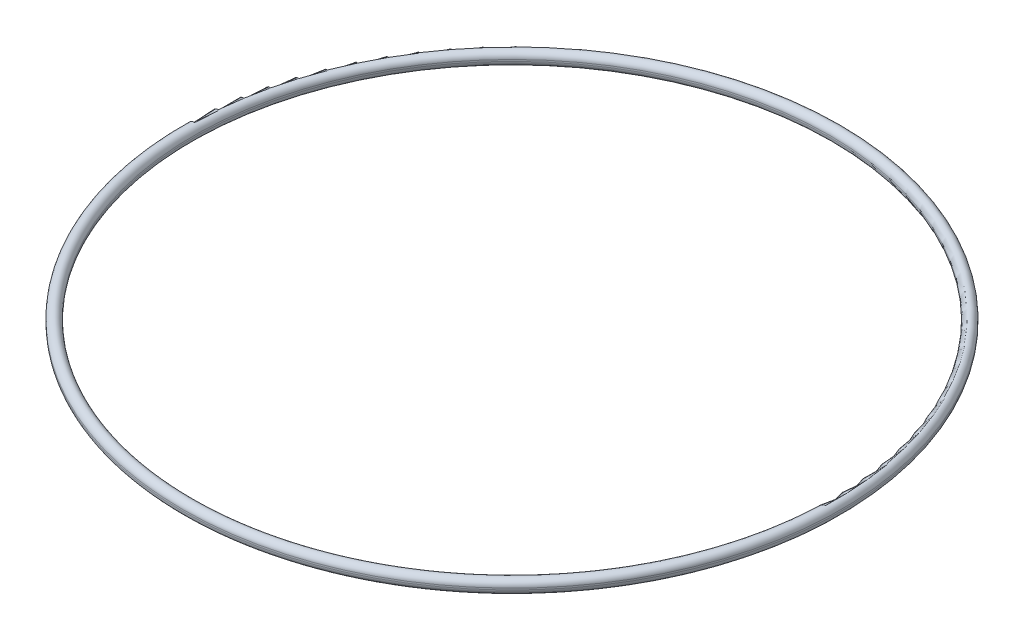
ISO-10303-21;
HEADER;
FILE_DESCRIPTION(('STEP AP214'),'2;1');
FILE_NAME('part.step','',(''),(''),'','','');
FILE_SCHEMA(('AUTOMOTIVE_DESIGN { 1 0 10303 214 1 1 1 1 }'));
ENDSEC;
DATA;
#1=APPLICATION_CONTEXT('core data for automotive mechanical design processes');
#2=APPLICATION_PROTOCOL_DEFINITION('international standard','automotive_design',2000,#1);
#3=PRODUCT_CONTEXT('',#1,'mechanical');
#4=PRODUCT('Part','Part','',(#3));
#5=PRODUCT_RELATED_PRODUCT_CATEGORY('part','',(#4));
#6=PRODUCT_DEFINITION_FORMATION('','',#4);
#7=PRODUCT_DEFINITION_CONTEXT('part definition',#1,'design');
#8=PRODUCT_DEFINITION('design','',#6,#7);
#9=PRODUCT_DEFINITION_SHAPE('','',#8);
#10=(LENGTH_UNIT() NAMED_UNIT(*) SI_UNIT(.MILLI.,.METRE.));
#11=(NAMED_UNIT(*) PLANE_ANGLE_UNIT() SI_UNIT($,.RADIAN.));
#12=(NAMED_UNIT(*) SI_UNIT($,.STERADIAN.) SOLID_ANGLE_UNIT());
#13=UNCERTAINTY_MEASURE_WITH_UNIT(LENGTH_MEASURE(1.E-05),#10,'distance_accuracy_value','');
#14=(GEOMETRIC_REPRESENTATION_CONTEXT(3) GLOBAL_UNCERTAINTY_ASSIGNED_CONTEXT((#13)) GLOBAL_UNIT_ASSIGNED_CONTEXT((#10,
#11,#12)) REPRESENTATION_CONTEXT('',''));
#15=CARTESIAN_POINT('',(0.,0.,0.));
#16=DIRECTION('',(0.,0.,1.));
#17=DIRECTION('',(1.,0.,0.));
#18=AXIS2_PLACEMENT_3D('',#15,#16,#17);
#19=CARTESIAN_POINT('',(0.,0.,0.));
#20=DIRECTION('',(0.,-1.,0.));
#21=DIRECTION('',(0.,0.,-1.));
#22=AXIS2_PLACEMENT_3D('',#19,#20,#21);
#23=TOROIDAL_SURFACE('',#22,37.5840625,0.674687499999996);
#24=CARTESIAN_POINT('',(0.,0.,0.));
#25=DIRECTION('',(0.,-1.,0.));
#26=DIRECTION('',(0.,0.,-1.));
#27=AXIS2_PLACEMENT_3D('',#24,#25,#26);
#28=CIRCLE('',#27,38.25875);
#29=CARTESIAN_POINT('',(0.,0.,-38.25875));
#30=VERTEX_POINT('',#29);
#31=EDGE_CURVE('E44',#30,#30,#28,.T.);
#32=ORIENTED_EDGE('',*,*,#31,.T.);
#33=EDGE_LOOP('',(#32));
#34=FACE_BOUND('',#33,.T.);
#35=CARTESIAN_POINT('',(0.,0.,0.));
#36=DIRECTION('',(0.,-1.,0.));
#37=DIRECTION('',(0.,0.,-1.));
#38=AXIS2_PLACEMENT_3D('',#35,#36,#37);
#39=CIRCLE('',#38,36.909375);
#40=CARTESIAN_POINT('',(0.,0.,-36.909375));
#41=VERTEX_POINT('',#40);
#42=EDGE_CURVE('E10',#41,#41,#39,.T.);
#43=ORIENTED_EDGE('',*,*,#42,.F.);
#44=EDGE_LOOP('',(#43));
#45=FACE_BOUND('',#44,.T.);
#46=ADVANCED_FACE('F30',(#34,#45),#23,.T.);
#47=CARTESIAN_POINT('',(0.,0.,0.));
#48=DIRECTION('',(0.,-1.,0.));
#49=DIRECTION('',(0.,0.,-1.));
#50=AXIS2_PLACEMENT_3D('',#47,#48,#49);
#51=CYLINDRICAL_SURFACE('',#50,36.909375);
#52=ORIENTED_EDGE('',*,*,#42,.T.);
#53=EDGE_LOOP('',(#52));
#54=FACE_BOUND('',#53,.T.);
#55=CARTESIAN_POINT('',(0.,0.1905,0.));
#56=DIRECTION('',(0.,-1.,0.));
#57=DIRECTION('',(0.,0.,-1.));
#58=AXIS2_PLACEMENT_3D('',#55,#56,#57);
#59=CIRCLE('',#58,36.909375);
#60=CARTESIAN_POINT('',(0.,0.1905,-36.909375));
#61=VERTEX_POINT('',#60);
#62=EDGE_CURVE('E36',#61,#61,#59,.T.);
#63=ORIENTED_EDGE('',*,*,#62,.F.);
#64=EDGE_LOOP('',(#63));
#65=FACE_BOUND('',#64,.T.);
#66=ADVANCED_FACE('F60',(#54,#65),#51,.F.);
#67=CARTESIAN_POINT('',(0.,0.1905,0.));
#68=DIRECTION('',(0.,-1.,0.));
#69=DIRECTION('',(0.,0.,-1.));
#70=AXIS2_PLACEMENT_3D('',#67,#68,#69);
#71=TOROIDAL_SURFACE('',#70,37.5840625,0.674687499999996);
#72=ORIENTED_EDGE('',*,*,#62,.T.);
#73=EDGE_LOOP('',(#72));
#74=FACE_BOUND('',#73,.T.);
#75=CARTESIAN_POINT('',(0.,0.1905,0.));
#76=DIRECTION('',(0.,-1.,0.));
#77=DIRECTION('',(0.,0.,-1.));
#78=AXIS2_PLACEMENT_3D('',#75,#76,#77);
#79=CIRCLE('',#78,38.25875);
#80=CARTESIAN_POINT('',(0.,0.1905,-38.25875));
#81=VERTEX_POINT('',#80);
#82=EDGE_CURVE('E40',#81,#81,#79,.T.);
#83=ORIENTED_EDGE('',*,*,#82,.F.);
#84=EDGE_LOOP('',(#83));
#85=FACE_BOUND('',#84,.T.);
#86=ADVANCED_FACE('F54',(#74,#85),#71,.T.);
#87=CARTESIAN_POINT('',(0.,0.,0.));
#88=DIRECTION('',(0.,-1.,0.));
#89=DIRECTION('',(0.,0.,-1.));
#90=AXIS2_PLACEMENT_3D('',#87,#88,#89);
#91=CYLINDRICAL_SURFACE('',#90,38.25875);
#92=ORIENTED_EDGE('',*,*,#82,.T.);
#93=EDGE_LOOP('',(#92));
#94=FACE_BOUND('',#93,.T.);
#95=ORIENTED_EDGE('',*,*,#31,.F.);
#96=EDGE_LOOP('',(#95));
#97=FACE_BOUND('',#96,.T.);
#98=ADVANCED_FACE('F52',(#94,#97),#91,.T.);
#99=CLOSED_SHELL('',(#46,#66,#86,#98));
#100=MANIFOLD_SOLID_BREP('B2',#99);
#101=ADVANCED_BREP_SHAPE_REPRESENTATION('',(#18,#100),#14);
#102=SHAPE_DEFINITION_REPRESENTATION(#9,#101);
ENDSEC;
END-ISO-10303-21;
